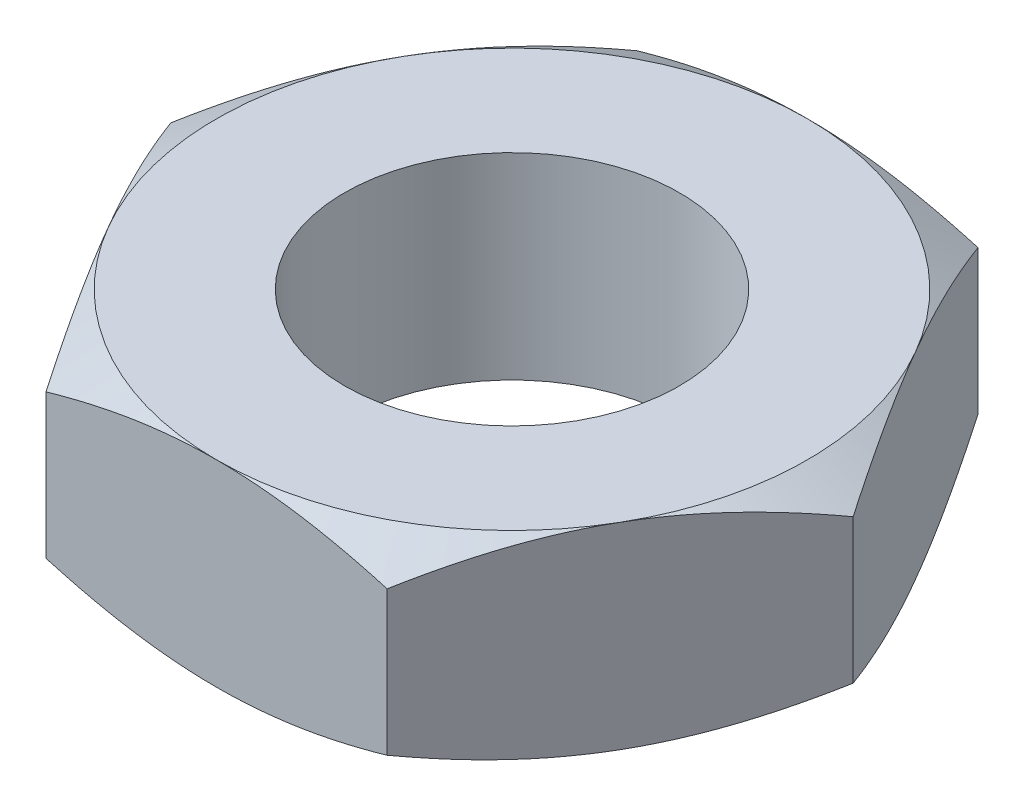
ISO-10303-21;
HEADER;
FILE_DESCRIPTION(('STEP AP214'),'2;1');
FILE_NAME('part.step','',(''),(''),'','','');
FILE_SCHEMA(('AUTOMOTIVE_DESIGN { 1 0 10303 214 1 1 1 1 }'));
ENDSEC;
DATA;
#1=APPLICATION_CONTEXT('core data for automotive mechanical design processes');
#2=APPLICATION_PROTOCOL_DEFINITION('international standard','automotive_design',2000,#1);
#3=PRODUCT_CONTEXT('',#1,'mechanical');
#4=PRODUCT('Part','Part','',(#3));
#5=PRODUCT_RELATED_PRODUCT_CATEGORY('part','',(#4));
#6=PRODUCT_DEFINITION_FORMATION('','',#4);
#7=PRODUCT_DEFINITION_CONTEXT('part definition',#1,'design');
#8=PRODUCT_DEFINITION('design','',#6,#7);
#9=PRODUCT_DEFINITION_SHAPE('','',#8);
#10=(LENGTH_UNIT() NAMED_UNIT(*) SI_UNIT(.MILLI.,.METRE.));
#11=(NAMED_UNIT(*) PLANE_ANGLE_UNIT() SI_UNIT($,.RADIAN.));
#12=(NAMED_UNIT(*) SI_UNIT($,.STERADIAN.) SOLID_ANGLE_UNIT());
#13=UNCERTAINTY_MEASURE_WITH_UNIT(LENGTH_MEASURE(1.E-05),#10,'distance_accuracy_value','');
#14=(GEOMETRIC_REPRESENTATION_CONTEXT(3) GLOBAL_UNCERTAINTY_ASSIGNED_CONTEXT((#13)) GLOBAL_UNIT_ASSIGNED_CONTEXT((#10,
#11,#12)) REPRESENTATION_CONTEXT('',''));
#15=CARTESIAN_POINT('',(0.,0.,0.));
#16=DIRECTION('',(0.,0.,1.));
#17=DIRECTION('',(1.,0.,0.));
#18=AXIS2_PLACEMENT_3D('',#15,#16,#17);
#19=CARTESIAN_POINT('',(10.3923048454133,-3.,0.));
#20=DIRECTION('',(0.,1.,0.));
#21=DIRECTION('',(0.,0.,1.));
#22=AXIS2_PLACEMENT_3D('',#19,#20,#21);
#23=PLANE('',#22);
#24=CARTESIAN_POINT('',(0.,-3.,0.));
#25=DIRECTION('',(0.,1.,0.));
#26=DIRECTION('',(0.,0.,1.));
#27=AXIS2_PLACEMENT_3D('',#24,#25,#26);
#28=CIRCLE('',#27,5.1);
#29=CARTESIAN_POINT('',(0.,-3.,5.1));
#30=VERTEX_POINT('',#29);
#31=EDGE_CURVE('E251',#30,#30,#28,.T.);
#32=ORIENTED_EDGE('',*,*,#31,.T.);
#33=EDGE_LOOP('',(#32));
#34=FACE_BOUND('',#33,.T.);
#35=CARTESIAN_POINT('',(0.,-3.,0.));
#36=DIRECTION('',(0.,1.,0.));
#37=DIRECTION('',(0.,0.,1.));
#38=AXIS2_PLACEMENT_3D('',#35,#36,#37);
#39=CIRCLE('',#38,9.00000000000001);
#40=CARTESIAN_POINT('',(0.,-3.,9.00000000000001));
#41=VERTEX_POINT('',#40);
#42=CARTESIAN_POINT('',(7.79422863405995,-3.,4.5));
#43=VERTEX_POINT('',#42);
#44=EDGE_CURVE('E137',#41,#43,#39,.T.);
#45=ORIENTED_EDGE('',*,*,#44,.F.);
#46=CARTESIAN_POINT('',(0.,-3.,0.));
#47=DIRECTION('',(0.,1.,0.));
#48=DIRECTION('',(0.,0.,1.));
#49=AXIS2_PLACEMENT_3D('',#46,#47,#48);
#50=CIRCLE('',#49,9.00000000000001);
#51=CARTESIAN_POINT('',(-7.79422863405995,-3.,4.5));
#52=VERTEX_POINT('',#51);
#53=EDGE_CURVE('E12',#41,#52,#50,.F.);
#54=ORIENTED_EDGE('',*,*,#53,.T.);
#55=CARTESIAN_POINT('',(-7.79422863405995,-3.,-4.5));
#56=VERTEX_POINT('',#55);
#57=EDGE_CURVE('E45',#52,#56,#50,.F.);
#58=ORIENTED_EDGE('',*,*,#57,.T.);
#59=CARTESIAN_POINT('',(0.,-3.,-9.00000000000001));
#60=VERTEX_POINT('',#59);
#61=EDGE_CURVE('E475',#56,#60,#50,.F.);
#62=ORIENTED_EDGE('',*,*,#61,.T.);
#63=CARTESIAN_POINT('',(7.79422863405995,-3.,-4.5));
#64=VERTEX_POINT('',#63);
#65=EDGE_CURVE('E145',#60,#64,#50,.F.);
#66=ORIENTED_EDGE('',*,*,#65,.T.);
#67=EDGE_CURVE('E46',#64,#43,#50,.F.);
#68=ORIENTED_EDGE('',*,*,#67,.T.);
#69=EDGE_LOOP('',(#45,#54,#58,#62,#66,#68));
#70=FACE_BOUND('',#69,.T.);
#71=ADVANCED_FACE('F36',(#34,#70),#23,.F.);
#72=CARTESIAN_POINT('',(5.19615242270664,3.,9.));
#73=DIRECTION('',(-0.866025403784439,0.,-0.5));
#74=DIRECTION('',(-0.5,0.,0.866025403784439));
#75=AXIS2_PLACEMENT_3D('',#72,#73,#74);
#76=PLANE('',#75);
#77=DIRECTION('',(0.,-1.,0.));
#78=VECTOR('',#77,1.);
#79=CARTESIAN_POINT('',(5.19615242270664,3.,9.));
#80=LINE('',#79,#78);
#81=CARTESIAN_POINT('',(5.19615242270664,2.19615242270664,9.));
#82=VERTEX_POINT('',#81);
#83=CARTESIAN_POINT('',(5.19615242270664,-2.19615242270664,9.));
#84=VERTEX_POINT('',#83);
#85=EDGE_CURVE('E150',#82,#84,#80,.T.);
#86=ORIENTED_EDGE('',*,*,#85,.T.);
#87=CARTESIAN_POINT('',(5.1960369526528,-2.19608575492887,9.0002));
#88=CARTESIAN_POINT('',(5.31024090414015,-2.26201799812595,8.80239295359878));
#89=CARTESIAN_POINT('',(5.42489028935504,-2.32495859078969,8.60381439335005));
#90=CARTESIAN_POINT('',(5.655120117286,-2.44403100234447,8.20504463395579));
#91=CARTESIAN_POINT('',(5.77070093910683,-2.50015988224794,8.00485277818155));
#92=CARTESIAN_POINT('',(6.00300811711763,-2.60484803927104,7.6024849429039));
#93=CARTESIAN_POINT('',(6.11973652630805,-2.65338922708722,7.4003054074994));
#94=CARTESIAN_POINT('',(6.35398725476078,-2.74185148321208,6.99457124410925));
#95=CARTESIAN_POINT('',(6.47150940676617,-2.78177431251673,6.79101690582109));
#96=CARTESIAN_POINT('',(6.70436794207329,-2.85131532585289,6.38769409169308));
#97=CARTESIAN_POINT('',(6.81968712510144,-2.8811624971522,6.18795540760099));
#98=CARTESIAN_POINT('',(7.05084147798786,-2.93120669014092,5.787584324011));
#99=CARTESIAN_POINT('',(7.16667660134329,-2.95140456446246,5.58695200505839));
#100=CARTESIAN_POINT('',(7.39854776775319,-2.98164565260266,5.18533936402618));
#101=CARTESIAN_POINT('',(7.51458343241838,-2.9917003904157,4.98435969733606));
#102=CARTESIAN_POINT('',(7.74676155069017,-3.00143766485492,4.58221540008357));
#103=CARTESIAN_POINT('',(7.86290400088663,-3.00112052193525,4.38105077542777));
#104=CARTESIAN_POINT('',(8.08003584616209,-2.99083604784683,4.00496738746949));
#105=CARTESIAN_POINT('',(8.18104055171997,-2.9821232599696,3.83002210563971));
#106=CARTESIAN_POINT('',(8.38281337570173,-2.95702265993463,3.48054132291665));
#107=CARTESIAN_POINT('',(8.48358147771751,-2.94063433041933,3.30600585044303));
#108=CARTESIAN_POINT('',(8.78549567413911,-2.88034344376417,2.78307512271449));
#109=CARTESIAN_POINT('',(8.98610736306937,-2.82532251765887,2.43560548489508));
#110=CARTESIAN_POINT('',(9.3894587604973,-2.68776952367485,1.736980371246));
#111=CARTESIAN_POINT('',(9.59214699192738,-2.60465438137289,1.38591405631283));
#112=CARTESIAN_POINT('',(9.99450087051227,-2.41601746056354,0.689016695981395));
#113=CARTESIAN_POINT('',(10.1941716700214,-2.31053998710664,0.343176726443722));
#114=CARTESIAN_POINT('',(10.3924203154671,-2.19608575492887,-0.000199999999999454));
#115=B_SPLINE_CURVE_WITH_KNOTS('',3,(#87,#88,#89,#90,#91,#92,#93,#94,#95,#96,#97,#98,#99,#100,
#101,#102,#103,#104,#105,#106,#107,#108,#109,#110,#111,#112,#113,#114),.UNSPECIFIED.,.F.,.F.,(4,
2,2,2,2,2,2,2,2,2,2,2,2,4),(0.,0.713219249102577,1.42674513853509,2.14194697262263,
2.85700253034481,3.55449749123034,4.25193080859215,4.94857085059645,5.64518936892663,
6.25162976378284,6.85811104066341,8.07193747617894,9.31268391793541,10.5509947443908),.UNSPECIFIED.);
#116=EDGE_CURVE('E58',#84,#43,#115,.T.);
#117=ORIENTED_EDGE('',*,*,#116,.T.);
#118=CARTESIAN_POINT('',(10.3923048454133,-2.19615242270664,0.));
#119=VERTEX_POINT('',#118);
#120=EDGE_CURVE('E126',#43,#119,#115,.T.);
#121=ORIENTED_EDGE('',*,*,#120,.T.);
#122=DIRECTION('',(0.,-1.,0.));
#123=VECTOR('',#122,1.);
#124=CARTESIAN_POINT('',(10.3923048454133,3.,0.));
#125=LINE('',#124,#123);
#126=CARTESIAN_POINT('',(10.3923048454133,2.19615242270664,0.));
#127=VERTEX_POINT('',#126);
#128=EDGE_CURVE('E267',#127,#119,#125,.T.);
#129=ORIENTED_EDGE('',*,*,#128,.F.);
#130=CARTESIAN_POINT('',(5.1960369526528,2.19608575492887,9.0002));
#131=CARTESIAN_POINT('',(5.31024090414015,2.26201799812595,8.80239295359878));
#132=CARTESIAN_POINT('',(5.42489028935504,2.32495859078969,8.60381439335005));
#133=CARTESIAN_POINT('',(5.655120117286,2.44403100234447,8.20504463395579));
#134=CARTESIAN_POINT('',(5.77070093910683,2.50015988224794,8.00485277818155));
#135=CARTESIAN_POINT('',(6.00300811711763,2.60484803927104,7.6024849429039));
#136=CARTESIAN_POINT('',(6.11973652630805,2.65338922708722,7.4003054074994));
#137=CARTESIAN_POINT('',(6.35398725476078,2.74185148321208,6.99457124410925));
#138=CARTESIAN_POINT('',(6.47150940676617,2.78177431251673,6.79101690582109));
#139=CARTESIAN_POINT('',(6.70436794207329,2.85131532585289,6.38769409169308));
#140=CARTESIAN_POINT('',(6.81968712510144,2.8811624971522,6.18795540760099));
#141=CARTESIAN_POINT('',(7.05084147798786,2.93120669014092,5.787584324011));
#142=CARTESIAN_POINT('',(7.16667660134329,2.95140456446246,5.58695200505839));
#143=CARTESIAN_POINT('',(7.39854776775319,2.98164565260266,5.18533936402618));
#144=CARTESIAN_POINT('',(7.51458343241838,2.9917003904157,4.98435969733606));
#145=CARTESIAN_POINT('',(7.74676155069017,3.00143766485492,4.58221540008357));
#146=CARTESIAN_POINT('',(7.86290400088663,3.00112052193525,4.38105077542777));
#147=CARTESIAN_POINT('',(8.08003584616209,2.99083604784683,4.00496738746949));
#148=CARTESIAN_POINT('',(8.18104055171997,2.9821232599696,3.83002210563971));
#149=CARTESIAN_POINT('',(8.38281337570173,2.95702265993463,3.48054132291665));
#150=CARTESIAN_POINT('',(8.48358147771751,2.94063433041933,3.30600585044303));
#151=CARTESIAN_POINT('',(8.78549567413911,2.88034344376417,2.78307512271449));
#152=CARTESIAN_POINT('',(8.98610736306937,2.82532251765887,2.43560548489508));
#153=CARTESIAN_POINT('',(9.3894587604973,2.68776952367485,1.736980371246));
#154=CARTESIAN_POINT('',(9.59214699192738,2.60465438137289,1.38591405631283));
#155=CARTESIAN_POINT('',(9.99450087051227,2.41601746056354,0.689016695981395));
#156=CARTESIAN_POINT('',(10.1941716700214,2.31053998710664,0.343176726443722));
#157=CARTESIAN_POINT('',(10.3924203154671,2.19608575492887,-0.000199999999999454));
#158=B_SPLINE_CURVE_WITH_KNOTS('',3,(#130,#131,#132,#133,#134,#135,#136,#137,#138,#139,#140,
#141,#142,#143,#144,#145,#146,#147,#148,#149,#150,#151,#152,#153,#154,#155,#156,#157),
.UNSPECIFIED.,.F.,.F.,(4,2,2,2,2,2,2,2,2,2,2,2,2,4),(0.,0.713219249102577,1.42674513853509,
2.14194697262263,2.85700253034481,3.55449749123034,4.25193080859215,4.94857085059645,
5.64518936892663,6.25162976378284,6.85811104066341,8.07193747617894,9.31268391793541,
10.5509947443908),.UNSPECIFIED.);
#159=CARTESIAN_POINT('',(7.79422863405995,3.,4.5));
#160=VERTEX_POINT('',#159);
#161=EDGE_CURVE('E241',#160,#127,#158,.T.);
#162=ORIENTED_EDGE('',*,*,#161,.F.);
#163=EDGE_CURVE('E247',#82,#160,#158,.T.);
#164=ORIENTED_EDGE('',*,*,#163,.F.);
#165=EDGE_LOOP('',(#86,#117,#121,#129,#162,#164));
#166=FACE_BOUND('',#165,.T.);
#167=ADVANCED_FACE('F38',(#166),#76,.F.);
#168=CARTESIAN_POINT('',(10.3923048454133,3.,0.));
#169=DIRECTION('',(-0.866025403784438,0.,0.5));
#170=DIRECTION('',(0.5,0.,0.866025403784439));
#171=AXIS2_PLACEMENT_3D('',#168,#169,#170);
#172=PLANE('',#171);
#173=ORIENTED_EDGE('',*,*,#128,.T.);
#174=CARTESIAN_POINT('',(10.3924203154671,-2.19608575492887,0.000200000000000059));
#175=CARTESIAN_POINT('',(10.2782163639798,-2.26201799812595,-0.197607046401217));
#176=CARTESIAN_POINT('',(10.1635669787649,-2.32495859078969,-0.396185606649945));
#177=CARTESIAN_POINT('',(9.93333715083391,-2.44403100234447,-0.79495536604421));
#178=CARTESIAN_POINT('',(9.81775632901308,-2.50015988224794,-0.995147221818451));
#179=CARTESIAN_POINT('',(9.58544915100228,-2.60484803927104,-1.3975150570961));
#180=CARTESIAN_POINT('',(9.46872074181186,-2.65338922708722,-1.5996945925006));
#181=CARTESIAN_POINT('',(9.23447001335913,-2.74185148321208,-2.00542875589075));
#182=CARTESIAN_POINT('',(9.11694786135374,-2.78177431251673,-2.20898309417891));
#183=CARTESIAN_POINT('',(8.88408932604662,-2.85131532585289,-2.61230590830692));
#184=CARTESIAN_POINT('',(8.76877014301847,-2.8811624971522,-2.81204459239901));
#185=CARTESIAN_POINT('',(8.53761579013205,-2.93120669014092,-3.212415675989));
#186=CARTESIAN_POINT('',(8.42178066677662,-2.95140456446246,-3.41304799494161));
#187=CARTESIAN_POINT('',(8.18990950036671,-2.98164565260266,-3.81466063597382));
#188=CARTESIAN_POINT('',(8.07387383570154,-2.9917003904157,-4.01564030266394));
#189=CARTESIAN_POINT('',(7.84169571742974,-3.00143766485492,-4.41778459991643));
#190=CARTESIAN_POINT('',(7.72555326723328,-3.00112052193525,-4.61894922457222));
#191=CARTESIAN_POINT('',(7.50842142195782,-2.99083604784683,-4.9950326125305));
#192=CARTESIAN_POINT('',(7.40741671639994,-2.98212325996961,-5.16997789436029));
#193=CARTESIAN_POINT('',(7.20564389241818,-2.95702265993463,-5.51945867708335));
#194=CARTESIAN_POINT('',(7.1048757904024,-2.94063433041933,-5.69399414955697));
#195=CARTESIAN_POINT('',(6.8029615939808,-2.88034344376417,-6.21692487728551));
#196=CARTESIAN_POINT('',(6.60234990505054,-2.82532251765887,-6.56439451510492));
#197=CARTESIAN_POINT('',(6.19899850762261,-2.68776952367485,-7.263019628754));
#198=CARTESIAN_POINT('',(5.99631027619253,-2.6046543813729,-7.61408594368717));
#199=CARTESIAN_POINT('',(5.59395639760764,-2.41601746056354,-8.31098330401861));
#200=CARTESIAN_POINT('',(5.39428559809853,-2.31053998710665,-8.65682327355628));
#201=CARTESIAN_POINT('',(5.19603695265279,-2.19608575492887,-9.0002));
#202=B_SPLINE_CURVE_WITH_KNOTS('',3,(#174,#175,#176,#177,#178,#179,#180,#181,#182,#183,#184,
#185,#186,#187,#188,#189,#190,#191,#192,#193,#194,#195,#196,#197,#198,#199,#200,#201),
.UNSPECIFIED.,.F.,.F.,(4,2,2,2,2,2,2,2,2,2,2,2,2,4),(0.,0.713219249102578,1.42674513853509,
2.14194697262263,2.85700253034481,3.55449749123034,4.25193080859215,4.94857085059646,
5.64518936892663,6.25162976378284,6.85811104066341,8.07193747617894,9.31268391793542,
10.5509947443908),.UNSPECIFIED.);
#203=EDGE_CURVE('E131',#119,#64,#202,.T.);
#204=ORIENTED_EDGE('',*,*,#203,.T.);
#205=CARTESIAN_POINT('',(5.19615242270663,-2.19615242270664,-9.));
#206=VERTEX_POINT('',#205);
#207=EDGE_CURVE('E161',#64,#206,#202,.T.);
#208=ORIENTED_EDGE('',*,*,#207,.T.);
#209=DIRECTION('',(0.,-1.,0.));
#210=VECTOR('',#209,1.);
#211=CARTESIAN_POINT('',(5.19615242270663,3.,-9.));
#212=LINE('',#211,#210);
#213=CARTESIAN_POINT('',(5.19615242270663,2.19615242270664,-9.));
#214=VERTEX_POINT('',#213);
#215=EDGE_CURVE('E264',#214,#206,#212,.T.);
#216=ORIENTED_EDGE('',*,*,#215,.F.);
#217=CARTESIAN_POINT('',(10.3924203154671,2.19608575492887,0.000200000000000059));
#218=CARTESIAN_POINT('',(10.2782163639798,2.26201799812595,-0.197607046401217));
#219=CARTESIAN_POINT('',(10.1635669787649,2.32495859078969,-0.396185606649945));
#220=CARTESIAN_POINT('',(9.93333715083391,2.44403100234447,-0.79495536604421));
#221=CARTESIAN_POINT('',(9.81775632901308,2.50015988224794,-0.995147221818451));
#222=CARTESIAN_POINT('',(9.58544915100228,2.60484803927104,-1.3975150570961));
#223=CARTESIAN_POINT('',(9.46872074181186,2.65338922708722,-1.5996945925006));
#224=CARTESIAN_POINT('',(9.23447001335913,2.74185148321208,-2.00542875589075));
#225=CARTESIAN_POINT('',(9.11694786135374,2.78177431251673,-2.20898309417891));
#226=CARTESIAN_POINT('',(8.88408932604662,2.85131532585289,-2.61230590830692));
#227=CARTESIAN_POINT('',(8.76877014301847,2.8811624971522,-2.81204459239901));
#228=CARTESIAN_POINT('',(8.53761579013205,2.93120669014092,-3.212415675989));
#229=CARTESIAN_POINT('',(8.42178066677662,2.95140456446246,-3.41304799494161));
#230=CARTESIAN_POINT('',(8.18990950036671,2.98164565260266,-3.81466063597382));
#231=CARTESIAN_POINT('',(8.07387383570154,2.9917003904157,-4.01564030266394));
#232=CARTESIAN_POINT('',(7.84169571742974,3.00143766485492,-4.41778459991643));
#233=CARTESIAN_POINT('',(7.72555326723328,3.00112052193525,-4.61894922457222));
#234=CARTESIAN_POINT('',(7.50842142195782,2.99083604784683,-4.9950326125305));
#235=CARTESIAN_POINT('',(7.40741671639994,2.98212325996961,-5.16997789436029));
#236=CARTESIAN_POINT('',(7.20564389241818,2.95702265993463,-5.51945867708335));
#237=CARTESIAN_POINT('',(7.1048757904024,2.94063433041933,-5.69399414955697));
#238=CARTESIAN_POINT('',(6.8029615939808,2.88034344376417,-6.21692487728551));
#239=CARTESIAN_POINT('',(6.60234990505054,2.82532251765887,-6.56439451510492));
#240=CARTESIAN_POINT('',(6.19899850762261,2.68776952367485,-7.263019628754));
#241=CARTESIAN_POINT('',(5.99631027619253,2.6046543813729,-7.61408594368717));
#242=CARTESIAN_POINT('',(5.59395639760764,2.41601746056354,-8.31098330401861));
#243=CARTESIAN_POINT('',(5.39428559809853,2.31053998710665,-8.65682327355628));
#244=CARTESIAN_POINT('',(5.19603695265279,2.19608575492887,-9.0002));
#245=B_SPLINE_CURVE_WITH_KNOTS('',3,(#217,#218,#219,#220,#221,#222,#223,#224,#225,#226,#227,
#228,#229,#230,#231,#232,#233,#234,#235,#236,#237,#238,#239,#240,#241,#242,#243,#244),
.UNSPECIFIED.,.F.,.F.,(4,2,2,2,2,2,2,2,2,2,2,2,2,4),(0.,0.713219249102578,1.42674513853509,
2.14194697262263,2.85700253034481,3.55449749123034,4.25193080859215,4.94857085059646,
5.64518936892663,6.25162976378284,6.85811104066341,8.07193747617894,9.31268391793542,
10.5509947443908),.UNSPECIFIED.);
#246=CARTESIAN_POINT('',(7.79422863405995,3.,-4.5));
#247=VERTEX_POINT('',#246);
#248=EDGE_CURVE('E234',#247,#214,#245,.T.);
#249=ORIENTED_EDGE('',*,*,#248,.F.);
#250=EDGE_CURVE('E240',#127,#247,#245,.T.);
#251=ORIENTED_EDGE('',*,*,#250,.F.);
#252=EDGE_LOOP('',(#173,#204,#208,#216,#249,#251));
#253=FACE_BOUND('',#252,.T.);
#254=ADVANCED_FACE('F213',(#253),#172,.F.);
#255=CARTESIAN_POINT('',(5.19615242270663,3.,-9.));
#256=DIRECTION('',(0.,0.,1.));
#257=DIRECTION('',(1.,0.,0.));
#258=AXIS2_PLACEMENT_3D('',#255,#256,#257);
#259=PLANE('',#258);
#260=ORIENTED_EDGE('',*,*,#215,.T.);
#261=CARTESIAN_POINT('',(-14.08790952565,1.45560380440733,-9.));
#262=CARTESIAN_POINT('',(-13.6936550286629,1.26383430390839,-9.));
#263=CARTESIAN_POINT('',(-13.2985092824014,1.07386641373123,-9.));
#264=CARTESIAN_POINT('',(-12.505961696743,0.698544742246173,-9.));
#265=CARTESIAN_POINT('',(-12.1085595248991,0.513191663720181,-9.));
#266=CARTESIAN_POINT('',(-11.309040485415,0.147206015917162,-9.));
#267=CARTESIAN_POINT('',(-10.9069098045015,-0.033396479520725,-9.));
#268=CARTESIAN_POINT('',(-10.0994948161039,-0.387381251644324,-9.));
#269=CARTESIAN_POINT('',(-9.69421065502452,-0.560763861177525,-9.));
#270=CARTESIAN_POINT('',(-8.86637898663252,-0.903989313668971,-9.));
#271=CARTESIAN_POINT('',(-8.44370370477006,-1.07352564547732,-9.));
#272=CARTESIAN_POINT('',(-7.59345787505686,-1.40008012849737,-9.));
#273=CARTESIAN_POINT('',(-7.16588679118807,-1.55709689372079,-9.));
#274=CARTESIAN_POINT('',(-6.30592235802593,-1.85458596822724,-9.));
#275=CARTESIAN_POINT('',(-5.87354032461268,-1.99509064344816,-9.));
#276=CARTESIAN_POINT('',(-5.00259089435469,-2.25513543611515,-9.));
#277=CARTESIAN_POINT('',(-4.56402544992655,-2.37468201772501,-9.));
#278=CARTESIAN_POINT('',(-3.68279147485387,-2.58652518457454,-9.));
#279=CARTESIAN_POINT('',(-3.24015978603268,-2.67897094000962,-9.));
#280=CARTESIAN_POINT('',(-2.57207975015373,-2.79336659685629,-9.));
#281=CARTESIAN_POINT('',(-2.34868256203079,-2.82745445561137,-9.));
#282=CARTESIAN_POINT('',(-1.90073399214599,-2.88687397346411,-9.));
#283=CARTESIAN_POINT('',(-1.67618272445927,-2.91220648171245,-9.));
#284=CARTESIAN_POINT('',(-1.22921881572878,-2.95328578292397,-9.));
#285=CARTESIAN_POINT('',(-1.00681754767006,-2.96915580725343,-9.));
#286=CARTESIAN_POINT('',(-0.561542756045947,-2.99147045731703,-9.));
#287=CARTESIAN_POINT('',(-0.338669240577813,-2.99791524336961,-9.));
#288=CARTESIAN_POINT('',(0.107152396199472,-3.00122518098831,-9.));
#289=CARTESIAN_POINT('',(0.330100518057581,-2.99809026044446,-9.));
#290=CARTESIAN_POINT('',(0.775663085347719,-2.98231893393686,-9.));
#291=CARTESIAN_POINT('',(0.998277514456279,-2.96968207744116,-9.));
#292=CARTESIAN_POINT('',(1.52928538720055,-2.92847699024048,-9.));
#293=CARTESIAN_POINT('',(1.83735365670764,-2.89562319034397,-9.));
#294=CARTESIAN_POINT('',(2.45127496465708,-2.81348089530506,-9.));
#295=CARTESIAN_POINT('',(2.75712771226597,-2.76419028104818,-9.));
#296=CARTESIAN_POINT('',(3.67096429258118,-2.59427111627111,-9.));
#297=CARTESIAN_POINT('',(4.27491194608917,-2.4516229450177,-9.));
#298=CARTESIAN_POINT('',(5.17834875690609,-2.2032990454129,-9.));
#299=CARTESIAN_POINT('',(5.48249505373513,-2.11358460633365,-9.));
#300=CARTESIAN_POINT('',(6.0878349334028,-1.92460437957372,-9.));
#301=CARTESIAN_POINT('',(6.38902849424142,-1.82533852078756,-9.));
#302=CARTESIAN_POINT('',(6.9885562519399,-1.61886770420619,-9.));
#303=CARTESIAN_POINT('',(7.28689127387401,-1.51166512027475,-9.));
#304=CARTESIAN_POINT('',(7.88107084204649,-1.29060569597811,-9.));
#305=CARTESIAN_POINT('',(8.17691543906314,-1.17674899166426,-9.));
#306=CARTESIAN_POINT('',(8.95441621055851,-0.869086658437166,-9.));
#307=CARTESIAN_POINT('',(9.43422210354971,-0.670610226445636,-9.));
#308=CARTESIAN_POINT('',(10.3890689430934,-0.262470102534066,-9.));
#309=CARTESIAN_POINT('',(10.8641094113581,-0.0528053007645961,-9.));
#310=CARTESIAN_POINT('',(11.8104820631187,0.375135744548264,-9.));
#311=CARTESIAN_POINT('',(12.2818128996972,0.593414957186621,-9.));
#312=CARTESIAN_POINT('',(13.2213264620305,1.0365822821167,-9.));
#313=CARTESIAN_POINT('',(13.6895093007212,1.26147015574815,-9.));
#314=CARTESIAN_POINT('',(14.624030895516,1.71679166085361,-9.));
#315=CARTESIAN_POINT('',(15.0903658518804,1.94723307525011,-9.));
#316=CARTESIAN_POINT('',(16.0209541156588,2.41228312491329,-9.));
#317=CARTESIAN_POINT('',(16.4852074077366,2.64689179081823,-9.));
#318=CARTESIAN_POINT('',(17.4119022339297,3.11942878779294,-9.));
#319=CARTESIAN_POINT('',(17.8743441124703,3.35735644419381,-9.));
#320=CARTESIAN_POINT('',(18.7977988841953,3.83597043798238,-9.));
#321=CARTESIAN_POINT('',(19.2588117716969,4.07665678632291,-9.));
#322=CARTESIAN_POINT('',(20.5465513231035,4.75300835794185,-9.));
#323=CARTESIAN_POINT('',(21.3719486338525,5.19120416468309,-9.00000000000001));
#324=CARTESIAN_POINT('',(23.0199314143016,6.07294903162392,-9.00000000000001));
#325=CARTESIAN_POINT('',(23.8425167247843,6.51649838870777,-9.00000000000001));
#326=CARTESIAN_POINT('',(25.4829119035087,7.40619804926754,-9.00000000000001));
#327=CARTESIAN_POINT('',(26.3007286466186,7.85233568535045,-9.00000000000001));
#328=CARTESIAN_POINT('',(27.5261617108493,8.5238268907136,-9.00000000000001));
#329=CARTESIAN_POINT('',(27.9344093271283,8.74802994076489,-9.00000000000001));
#330=CARTESIAN_POINT('',(28.7505282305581,9.19711874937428,-9.00000000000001));
#331=CARTESIAN_POINT('',(29.1583995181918,9.42200450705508,-9.00000000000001));
#332=CARTESIAN_POINT('',(29.5661053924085,9.64718982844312,-9.00000000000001));
#333=B_SPLINE_CURVE_WITH_KNOTS('',3,(#261,#262,#263,#264,#265,#266,#267,#268,#269,#270,#271,
#272,#273,#274,#275,#276,#277,#278,#279,#280,#281,#282,#283,#284,#285,#286,#287,#288,#289,#290,
#291,#292,#293,#294,#295,#296,#297,#298,#299,#300,#301,#302,#303,#304,#305,#306,#307,#308,#309,
#310,#311,#312,#313,#314,#315,#316,#317,#318,#319,#320,#321,#322,#323,#324,#325,#326,#327,#328,
#329,#330,#331,#332),.UNSPECIFIED.,.F.,.F.,(4,2,2,2,2,2,2,2,2,2,2,2,2,2,2,2,2,2,2,2,2,2,2,2,2,2,
2,2,2,2,2,2,2,2,2,4),(0.,1.31527562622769,2.63075034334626,3.95316726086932,5.27552314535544,
6.64159484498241,8.00781756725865,9.37131599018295,10.7343931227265,12.0898202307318,
12.7676245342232,13.4453630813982,14.1140707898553,14.7827671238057,15.4514684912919,
16.1202015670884,17.0491251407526,17.9781685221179,19.8371982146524,20.7884210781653,
21.7396510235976,22.6905975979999,23.6415247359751,25.199025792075,26.7566816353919,
28.3148791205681,29.8730204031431,31.4334893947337,32.9939698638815,34.5541376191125,
36.1143115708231,38.9177907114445,41.7214260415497,44.5161918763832,45.9134738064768,
47.3107539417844),.UNSPECIFIED.);
#334=EDGE_CURVE('E207',#206,#60,#333,.F.);
#335=ORIENTED_EDGE('',*,*,#334,.T.);
#336=CARTESIAN_POINT('',(-5.19615242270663,-2.19615242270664,-9.));
#337=VERTEX_POINT('',#336);
#338=EDGE_CURVE('E200',#60,#337,#333,.F.);
#339=ORIENTED_EDGE('',*,*,#338,.T.);
#340=DIRECTION('',(0.,-1.,0.));
#341=VECTOR('',#340,1.);
#342=CARTESIAN_POINT('',(-5.19615242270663,3.,-9.));
#343=LINE('',#342,#341);
#344=CARTESIAN_POINT('',(-5.19615242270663,2.19615242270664,-9.));
#345=VERTEX_POINT('',#344);
#346=EDGE_CURVE('E261',#345,#337,#343,.T.);
#347=ORIENTED_EDGE('',*,*,#346,.F.);
#348=CARTESIAN_POINT('',(-14.08790952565,-1.45560380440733,-9.));
#349=CARTESIAN_POINT('',(-13.6936550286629,-1.26383430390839,-9.));
#350=CARTESIAN_POINT('',(-13.2985092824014,-1.07386641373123,-9.));
#351=CARTESIAN_POINT('',(-12.505961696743,-0.698544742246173,-9.));
#352=CARTESIAN_POINT('',(-12.1085595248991,-0.513191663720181,-9.));
#353=CARTESIAN_POINT('',(-11.309040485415,-0.147206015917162,-9.));
#354=CARTESIAN_POINT('',(-10.9069098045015,0.033396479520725,-9.));
#355=CARTESIAN_POINT('',(-10.0994948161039,0.387381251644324,-9.));
#356=CARTESIAN_POINT('',(-9.69421065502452,0.560763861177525,-9.));
#357=CARTESIAN_POINT('',(-8.86637898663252,0.903989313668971,-9.));
#358=CARTESIAN_POINT('',(-8.44370370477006,1.07352564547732,-9.));
#359=CARTESIAN_POINT('',(-7.59345787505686,1.40008012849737,-9.));
#360=CARTESIAN_POINT('',(-7.16588679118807,1.55709689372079,-9.));
#361=CARTESIAN_POINT('',(-6.30592235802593,1.85458596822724,-9.));
#362=CARTESIAN_POINT('',(-5.87354032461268,1.99509064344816,-9.));
#363=CARTESIAN_POINT('',(-5.00259089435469,2.25513543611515,-9.));
#364=CARTESIAN_POINT('',(-4.56402544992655,2.37468201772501,-9.));
#365=CARTESIAN_POINT('',(-3.68279147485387,2.58652518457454,-9.));
#366=CARTESIAN_POINT('',(-3.24015978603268,2.67897094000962,-9.));
#367=CARTESIAN_POINT('',(-2.57207975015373,2.79336659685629,-9.));
#368=CARTESIAN_POINT('',(-2.34868256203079,2.82745445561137,-9.));
#369=CARTESIAN_POINT('',(-1.90073399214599,2.88687397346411,-9.));
#370=CARTESIAN_POINT('',(-1.67618272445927,2.91220648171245,-9.));
#371=CARTESIAN_POINT('',(-1.22921881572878,2.95328578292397,-9.));
#372=CARTESIAN_POINT('',(-1.00681754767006,2.96915580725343,-9.));
#373=CARTESIAN_POINT('',(-0.561542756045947,2.99147045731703,-9.));
#374=CARTESIAN_POINT('',(-0.338669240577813,2.99791524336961,-9.));
#375=CARTESIAN_POINT('',(0.107152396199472,3.00122518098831,-9.));
#376=CARTESIAN_POINT('',(0.330100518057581,2.99809026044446,-9.));
#377=CARTESIAN_POINT('',(0.775663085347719,2.98231893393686,-9.));
#378=CARTESIAN_POINT('',(0.998277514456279,2.96968207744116,-9.));
#379=CARTESIAN_POINT('',(1.52928538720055,2.92847699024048,-9.));
#380=CARTESIAN_POINT('',(1.83735365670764,2.89562319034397,-9.));
#381=CARTESIAN_POINT('',(2.45127496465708,2.81348089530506,-9.));
#382=CARTESIAN_POINT('',(2.75712771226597,2.76419028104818,-9.));
#383=CARTESIAN_POINT('',(3.67096429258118,2.59427111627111,-9.));
#384=CARTESIAN_POINT('',(4.27491194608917,2.4516229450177,-9.));
#385=CARTESIAN_POINT('',(5.17834875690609,2.2032990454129,-9.));
#386=CARTESIAN_POINT('',(5.48249505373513,2.11358460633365,-9.));
#387=CARTESIAN_POINT('',(6.0878349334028,1.92460437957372,-9.));
#388=CARTESIAN_POINT('',(6.38902849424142,1.82533852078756,-9.));
#389=CARTESIAN_POINT('',(6.9885562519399,1.61886770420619,-9.));
#390=CARTESIAN_POINT('',(7.28689127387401,1.51166512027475,-9.));
#391=CARTESIAN_POINT('',(7.88107084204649,1.29060569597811,-9.));
#392=CARTESIAN_POINT('',(8.17691543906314,1.17674899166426,-9.));
#393=CARTESIAN_POINT('',(8.95441621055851,0.869086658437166,-9.));
#394=CARTESIAN_POINT('',(9.43422210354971,0.670610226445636,-9.));
#395=CARTESIAN_POINT('',(10.3890689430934,0.262470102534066,-9.));
#396=CARTESIAN_POINT('',(10.8641094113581,0.0528053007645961,-9.));
#397=CARTESIAN_POINT('',(11.8104820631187,-0.375135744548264,-9.));
#398=CARTESIAN_POINT('',(12.2818128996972,-0.593414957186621,-9.));
#399=CARTESIAN_POINT('',(13.2213264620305,-1.0365822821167,-9.));
#400=CARTESIAN_POINT('',(13.6895093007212,-1.26147015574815,-9.));
#401=CARTESIAN_POINT('',(14.624030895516,-1.71679166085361,-9.));
#402=CARTESIAN_POINT('',(15.0903658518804,-1.94723307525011,-9.));
#403=CARTESIAN_POINT('',(16.0209541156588,-2.41228312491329,-9.));
#404=CARTESIAN_POINT('',(16.4852074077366,-2.64689179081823,-9.));
#405=CARTESIAN_POINT('',(17.4119022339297,-3.11942878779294,-9.));
#406=CARTESIAN_POINT('',(17.8743441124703,-3.35735644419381,-9.));
#407=CARTESIAN_POINT('',(18.7977988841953,-3.83597043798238,-9.));
#408=CARTESIAN_POINT('',(19.2588117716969,-4.07665678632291,-9.));
#409=CARTESIAN_POINT('',(20.5465513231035,-4.75300835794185,-9.));
#410=CARTESIAN_POINT('',(21.3719486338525,-5.19120416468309,-9.00000000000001));
#411=CARTESIAN_POINT('',(23.0199314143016,-6.07294903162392,-9.00000000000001));
#412=CARTESIAN_POINT('',(23.8425167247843,-6.51649838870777,-9.00000000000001));
#413=CARTESIAN_POINT('',(25.4829119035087,-7.40619804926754,-9.00000000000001));
#414=CARTESIAN_POINT('',(26.3007286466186,-7.85233568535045,-9.00000000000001));
#415=CARTESIAN_POINT('',(27.5261617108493,-8.5238268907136,-9.00000000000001));
#416=CARTESIAN_POINT('',(27.9344093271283,-8.74802994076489,-9.00000000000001));
#417=CARTESIAN_POINT('',(28.7505282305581,-9.19711874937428,-9.00000000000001));
#418=CARTESIAN_POINT('',(29.1583995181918,-9.42200450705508,-9.00000000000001));
#419=CARTESIAN_POINT('',(29.5661053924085,-9.64718982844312,-9.00000000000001));
#420=B_SPLINE_CURVE_WITH_KNOTS('',3,(#348,#349,#350,#351,#352,#353,#354,#355,#356,#357,#358,
#359,#360,#361,#362,#363,#364,#365,#366,#367,#368,#369,#370,#371,#372,#373,#374,#375,#376,#377,
#378,#379,#380,#381,#382,#383,#384,#385,#386,#387,#388,#389,#390,#391,#392,#393,#394,#395,#396,
#397,#398,#399,#400,#401,#402,#403,#404,#405,#406,#407,#408,#409,#410,#411,#412,#413,#414,#415,
#416,#417,#418,#419),.UNSPECIFIED.,.F.,.F.,(4,2,2,2,2,2,2,2,2,2,2,2,2,2,2,2,2,2,2,2,2,2,2,2,2,2,
2,2,2,2,2,2,2,2,2,4),(0.,1.31527562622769,2.63075034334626,3.95316726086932,5.27552314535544,
6.64159484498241,8.00781756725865,9.37131599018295,10.7343931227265,12.0898202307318,
12.7676245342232,13.4453630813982,14.1140707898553,14.7827671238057,15.4514684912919,
16.1202015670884,17.0491251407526,17.9781685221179,19.8371982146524,20.7884210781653,
21.7396510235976,22.6905975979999,23.6415247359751,25.199025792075,26.7566816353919,
28.3148791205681,29.8730204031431,31.4334893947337,32.9939698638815,34.5541376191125,
36.1143115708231,38.9177907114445,41.7214260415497,44.5161918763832,45.9134738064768,
47.3107539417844),.UNSPECIFIED.);
#421=CARTESIAN_POINT('',(0.,3.,-9.00000000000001));
#422=VERTEX_POINT('',#421);
#423=EDGE_CURVE('E219',#422,#345,#420,.F.);
#424=ORIENTED_EDGE('',*,*,#423,.F.);
#425=EDGE_CURVE('E226',#214,#422,#420,.F.);
#426=ORIENTED_EDGE('',*,*,#425,.F.);
#427=EDGE_LOOP('',(#260,#335,#339,#347,#424,#426));
#428=FACE_BOUND('',#427,.T.);
#429=ADVANCED_FACE('F209',(#428),#259,.F.);
#430=CARTESIAN_POINT('',(-5.19615242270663,3.,-9.));
#431=DIRECTION('',(0.866025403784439,0.,0.5));
#432=DIRECTION('',(0.5,0.,-0.866025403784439));
#433=AXIS2_PLACEMENT_3D('',#430,#431,#432);
#434=PLANE('',#433);
#435=ORIENTED_EDGE('',*,*,#346,.T.);
#436=CARTESIAN_POINT('',(-5.19603695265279,-2.19608575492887,-9.0002));
#437=CARTESIAN_POINT('',(-5.31024090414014,-2.26201799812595,-8.80239295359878));
#438=CARTESIAN_POINT('',(-5.42489028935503,-2.32495859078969,-8.60381439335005));
#439=CARTESIAN_POINT('',(-5.65512011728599,-2.44403100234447,-8.20504463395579));
#440=CARTESIAN_POINT('',(-5.77070093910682,-2.50015988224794,-8.00485277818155));
#441=CARTESIAN_POINT('',(-6.00300811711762,-2.60484803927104,-7.6024849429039));
#442=CARTESIAN_POINT('',(-6.11973652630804,-2.65338922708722,-7.4003054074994));
#443=CARTESIAN_POINT('',(-6.35398725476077,-2.74185148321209,-6.99457124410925));
#444=CARTESIAN_POINT('',(-6.47150940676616,-2.78177431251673,-6.79101690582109));
#445=CARTESIAN_POINT('',(-6.70436794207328,-2.85131532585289,-6.38769409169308));
#446=CARTESIAN_POINT('',(-6.81968712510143,-2.88116249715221,-6.187955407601));
#447=CARTESIAN_POINT('',(-7.05084147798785,-2.93120669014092,-5.787584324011));
#448=CARTESIAN_POINT('',(-7.16667660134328,-2.95140456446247,-5.58695200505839));
#449=CARTESIAN_POINT('',(-7.39854776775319,-2.98164565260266,-5.18533936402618));
#450=CARTESIAN_POINT('',(-7.51458343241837,-2.9917003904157,-4.98435969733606));
#451=CARTESIAN_POINT('',(-7.74676155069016,-3.00143766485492,-4.58221540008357));
#452=CARTESIAN_POINT('',(-7.86290400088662,-3.00112052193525,-4.38105077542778));
#453=CARTESIAN_POINT('',(-8.08003584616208,-2.99083604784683,-4.0049673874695));
#454=CARTESIAN_POINT('',(-8.18104055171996,-2.98212325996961,-3.83002210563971));
#455=CARTESIAN_POINT('',(-8.38281337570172,-2.95702265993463,-3.48054132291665));
#456=CARTESIAN_POINT('',(-8.4835814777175,-2.94063433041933,-3.30600585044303));
#457=CARTESIAN_POINT('',(-8.7854956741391,-2.88034344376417,-2.7830751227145));
#458=CARTESIAN_POINT('',(-8.98610736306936,-2.82532251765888,-2.43560548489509));
#459=CARTESIAN_POINT('',(-9.38945876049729,-2.68776952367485,-1.736980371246));
#460=CARTESIAN_POINT('',(-9.59214699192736,-2.6046543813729,-1.38591405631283));
#461=CARTESIAN_POINT('',(-9.99450087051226,-2.41601746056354,-0.6890166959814));
#462=CARTESIAN_POINT('',(-10.1941716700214,-2.31053998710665,-0.343176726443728));
#463=CARTESIAN_POINT('',(-10.3924203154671,-2.19608575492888,0.000199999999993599));
#464=B_SPLINE_CURVE_WITH_KNOTS('',3,(#436,#437,#438,#439,#440,#441,#442,#443,#444,#445,#446,
#447,#448,#449,#450,#451,#452,#453,#454,#455,#456,#457,#458,#459,#460,#461,#462,#463),
.UNSPECIFIED.,.F.,.F.,(4,2,2,2,2,2,2,2,2,2,2,2,2,4),(0.,0.713219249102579,1.42674513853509,
2.14194697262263,2.85700253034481,3.55449749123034,4.25193080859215,4.94857085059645,
5.64518936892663,6.25162976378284,6.8581110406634,8.07193747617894,9.31268391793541,
10.5509947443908),.UNSPECIFIED.);
#465=EDGE_CURVE('E208',#337,#56,#464,.T.);
#466=ORIENTED_EDGE('',*,*,#465,.T.);
#467=CARTESIAN_POINT('',(-10.3923048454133,-2.19615242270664,0.));
#468=VERTEX_POINT('',#467);
#469=EDGE_CURVE('E194',#56,#468,#464,.T.);
#470=ORIENTED_EDGE('',*,*,#469,.T.);
#471=DIRECTION('',(0.,-1.,0.));
#472=VECTOR('',#471,1.);
#473=CARTESIAN_POINT('',(-10.3923048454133,3.,0.));
#474=LINE('',#473,#472);
#475=CARTESIAN_POINT('',(-10.3923048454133,2.19615242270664,0.));
#476=VERTEX_POINT('',#475);
#477=EDGE_CURVE('E258',#476,#468,#474,.T.);
#478=ORIENTED_EDGE('',*,*,#477,.F.);
#479=CARTESIAN_POINT('',(-5.19603695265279,2.19608575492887,-9.0002));
#480=CARTESIAN_POINT('',(-5.31024090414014,2.26201799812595,-8.80239295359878));
#481=CARTESIAN_POINT('',(-5.42489028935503,2.32495859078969,-8.60381439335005));
#482=CARTESIAN_POINT('',(-5.65512011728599,2.44403100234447,-8.20504463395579));
#483=CARTESIAN_POINT('',(-5.77070093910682,2.50015988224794,-8.00485277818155));
#484=CARTESIAN_POINT('',(-6.00300811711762,2.60484803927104,-7.6024849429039));
#485=CARTESIAN_POINT('',(-6.11973652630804,2.65338922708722,-7.4003054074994));
#486=CARTESIAN_POINT('',(-6.35398725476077,2.74185148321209,-6.99457124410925));
#487=CARTESIAN_POINT('',(-6.47150940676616,2.78177431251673,-6.79101690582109));
#488=CARTESIAN_POINT('',(-6.70436794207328,2.85131532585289,-6.38769409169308));
#489=CARTESIAN_POINT('',(-6.81968712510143,2.88116249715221,-6.187955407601));
#490=CARTESIAN_POINT('',(-7.05084147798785,2.93120669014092,-5.787584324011));
#491=CARTESIAN_POINT('',(-7.16667660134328,2.95140456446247,-5.58695200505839));
#492=CARTESIAN_POINT('',(-7.39854776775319,2.98164565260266,-5.18533936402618));
#493=CARTESIAN_POINT('',(-7.51458343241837,2.9917003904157,-4.98435969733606));
#494=CARTESIAN_POINT('',(-7.74676155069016,3.00143766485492,-4.58221540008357));
#495=CARTESIAN_POINT('',(-7.86290400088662,3.00112052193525,-4.38105077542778));
#496=CARTESIAN_POINT('',(-8.08003584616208,2.99083604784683,-4.0049673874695));
#497=CARTESIAN_POINT('',(-8.18104055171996,2.98212325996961,-3.83002210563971));
#498=CARTESIAN_POINT('',(-8.38281337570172,2.95702265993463,-3.48054132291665));
#499=CARTESIAN_POINT('',(-8.4835814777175,2.94063433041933,-3.30600585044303));
#500=CARTESIAN_POINT('',(-8.7854956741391,2.88034344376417,-2.7830751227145));
#501=CARTESIAN_POINT('',(-8.98610736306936,2.82532251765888,-2.43560548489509));
#502=CARTESIAN_POINT('',(-9.38945876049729,2.68776952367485,-1.736980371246));
#503=CARTESIAN_POINT('',(-9.59214699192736,2.6046543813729,-1.38591405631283));
#504=CARTESIAN_POINT('',(-9.99450087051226,2.41601746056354,-0.6890166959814));
#505=CARTESIAN_POINT('',(-10.1941716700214,2.31053998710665,-0.343176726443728));
#506=CARTESIAN_POINT('',(-10.3924203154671,2.19608575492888,0.000199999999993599));
#507=B_SPLINE_CURVE_WITH_KNOTS('',3,(#479,#480,#481,#482,#483,#484,#485,#486,#487,#488,#489,
#490,#491,#492,#493,#494,#495,#496,#497,#498,#499,#500,#501,#502,#503,#504,#505,#506),
.UNSPECIFIED.,.F.,.F.,(4,2,2,2,2,2,2,2,2,2,2,2,2,4),(0.,0.713219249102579,1.42674513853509,
2.14194697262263,2.85700253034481,3.55449749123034,4.25193080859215,4.94857085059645,
5.64518936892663,6.25162976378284,6.8581110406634,8.07193747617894,9.31268391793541,
10.5509947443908),.UNSPECIFIED.);
#508=CARTESIAN_POINT('',(-7.79422863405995,3.,-4.5));
#509=VERTEX_POINT('',#508);
#510=EDGE_CURVE('E228',#509,#476,#507,.T.);
#511=ORIENTED_EDGE('',*,*,#510,.F.);
#512=EDGE_CURVE('E227',#345,#509,#507,.T.);
#513=ORIENTED_EDGE('',*,*,#512,.F.);
#514=EDGE_LOOP('',(#435,#466,#470,#478,#511,#513));
#515=FACE_BOUND('',#514,.T.);
#516=ADVANCED_FACE('F212',(#515),#434,.F.);
#517=CARTESIAN_POINT('',(-10.3923048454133,3.,0.));
#518=DIRECTION('',(0.866025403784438,0.,-0.5));
#519=DIRECTION('',(-0.5,0.,-0.866025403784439));
#520=AXIS2_PLACEMENT_3D('',#517,#518,#519);
#521=PLANE('',#520);
#522=ORIENTED_EDGE('',*,*,#477,.T.);
#523=CARTESIAN_POINT('',(-10.3924203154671,-2.19608575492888,-0.000200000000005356));
#524=CARTESIAN_POINT('',(-10.2782163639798,-2.26201799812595,0.197607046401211));
#525=CARTESIAN_POINT('',(-10.1635669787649,-2.3249585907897,0.396185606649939));
#526=CARTESIAN_POINT('',(-9.9333371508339,-2.44403100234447,0.794955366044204));
#527=CARTESIAN_POINT('',(-9.81775632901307,-2.50015988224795,0.995147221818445));
#528=CARTESIAN_POINT('',(-9.58544915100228,-2.60484803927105,1.39751505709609));
#529=CARTESIAN_POINT('',(-9.46872074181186,-2.65338922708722,1.59969459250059));
#530=CARTESIAN_POINT('',(-9.23447001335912,-2.74185148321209,2.00542875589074));
#531=CARTESIAN_POINT('',(-9.11694786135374,-2.78177431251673,2.2089830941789));
#532=CARTESIAN_POINT('',(-8.88408932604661,-2.85131532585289,2.61230590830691));
#533=CARTESIAN_POINT('',(-8.76877014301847,-2.88116249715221,2.812044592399));
#534=CARTESIAN_POINT('',(-8.53761579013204,-2.93120669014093,3.21241567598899));
#535=CARTESIAN_POINT('',(-8.42178066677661,-2.95140456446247,3.4130479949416));
#536=CARTESIAN_POINT('',(-8.18990950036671,-2.98164565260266,3.81466063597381));
#537=CARTESIAN_POINT('',(-8.07387383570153,-2.9917003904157,4.01564030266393));
#538=CARTESIAN_POINT('',(-7.84169571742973,-3.00143766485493,4.41778459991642));
#539=CARTESIAN_POINT('',(-7.72555326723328,-3.00112052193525,4.61894922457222));
#540=CARTESIAN_POINT('',(-7.50842142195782,-2.99083604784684,4.9950326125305));
#541=CARTESIAN_POINT('',(-7.40741671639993,-2.98212325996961,5.16997789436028));
#542=CARTESIAN_POINT('',(-7.20564389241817,-2.95702265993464,5.51945867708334));
#543=CARTESIAN_POINT('',(-7.10487579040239,-2.94063433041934,5.69399414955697));
#544=CARTESIAN_POINT('',(-6.80296159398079,-2.88034344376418,6.2169248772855));
#545=CARTESIAN_POINT('',(-6.60234990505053,-2.82532251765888,6.56439451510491));
#546=CARTESIAN_POINT('',(-6.1989985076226,-2.68776952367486,7.263019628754));
#547=CARTESIAN_POINT('',(-5.99631027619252,-2.6046543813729,7.61408594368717));
#548=CARTESIAN_POINT('',(-5.59395639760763,-2.41601746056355,8.3109833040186));
#549=CARTESIAN_POINT('',(-5.39428559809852,-2.31053998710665,8.65682327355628));
#550=CARTESIAN_POINT('',(-5.19603695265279,-2.19608575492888,9.0002));
#551=B_SPLINE_CURVE_WITH_KNOTS('',3,(#523,#524,#525,#526,#527,#528,#529,#530,#531,#532,#533,
#534,#535,#536,#537,#538,#539,#540,#541,#542,#543,#544,#545,#546,#547,#548,#549,#550),
.UNSPECIFIED.,.F.,.F.,(4,2,2,2,2,2,2,2,2,2,2,2,2,4),(0.,0.713219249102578,1.42674513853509,
2.14194697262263,2.8570025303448,3.55449749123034,4.25193080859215,4.94857085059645,
5.64518936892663,6.25162976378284,6.85811104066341,8.07193747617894,9.31268391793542,
10.5509947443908),.UNSPECIFIED.);
#552=EDGE_CURVE('E472',#468,#52,#551,.T.);
#553=ORIENTED_EDGE('',*,*,#552,.T.);
#554=CARTESIAN_POINT('',(-5.19615242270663,-2.19615242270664,9.));
#555=VERTEX_POINT('',#554);
#556=EDGE_CURVE('E187',#52,#555,#551,.T.);
#557=ORIENTED_EDGE('',*,*,#556,.T.);
#558=DIRECTION('',(0.,-1.,0.));
#559=VECTOR('',#558,1.);
#560=CARTESIAN_POINT('',(-5.19615242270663,3.,9.));
#561=LINE('',#560,#559);
#562=CARTESIAN_POINT('',(-5.19615242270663,2.19615242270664,9.));
#563=VERTEX_POINT('',#562);
#564=EDGE_CURVE('E255',#563,#555,#561,.T.);
#565=ORIENTED_EDGE('',*,*,#564,.F.);
#566=CARTESIAN_POINT('',(-10.3924203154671,2.19608575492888,-0.000200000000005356));
#567=CARTESIAN_POINT('',(-10.2782163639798,2.26201799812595,0.197607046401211));
#568=CARTESIAN_POINT('',(-10.1635669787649,2.3249585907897,0.396185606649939));
#569=CARTESIAN_POINT('',(-9.9333371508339,2.44403100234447,0.794955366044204));
#570=CARTESIAN_POINT('',(-9.81775632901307,2.50015988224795,0.995147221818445));
#571=CARTESIAN_POINT('',(-9.58544915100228,2.60484803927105,1.39751505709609));
#572=CARTESIAN_POINT('',(-9.46872074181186,2.65338922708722,1.59969459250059));
#573=CARTESIAN_POINT('',(-9.23447001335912,2.74185148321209,2.00542875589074));
#574=CARTESIAN_POINT('',(-9.11694786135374,2.78177431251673,2.2089830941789));
#575=CARTESIAN_POINT('',(-8.88408932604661,2.85131532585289,2.61230590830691));
#576=CARTESIAN_POINT('',(-8.76877014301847,2.88116249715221,2.812044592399));
#577=CARTESIAN_POINT('',(-8.53761579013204,2.93120669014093,3.21241567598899));
#578=CARTESIAN_POINT('',(-8.42178066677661,2.95140456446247,3.4130479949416));
#579=CARTESIAN_POINT('',(-8.18990950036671,2.98164565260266,3.81466063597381));
#580=CARTESIAN_POINT('',(-8.07387383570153,2.9917003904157,4.01564030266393));
#581=CARTESIAN_POINT('',(-7.84169571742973,3.00143766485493,4.41778459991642));
#582=CARTESIAN_POINT('',(-7.72555326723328,3.00112052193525,4.61894922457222));
#583=CARTESIAN_POINT('',(-7.50842142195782,2.99083604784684,4.9950326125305));
#584=CARTESIAN_POINT('',(-7.40741671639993,2.98212325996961,5.16997789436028));
#585=CARTESIAN_POINT('',(-7.20564389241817,2.95702265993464,5.51945867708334));
#586=CARTESIAN_POINT('',(-7.10487579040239,2.94063433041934,5.69399414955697));
#587=CARTESIAN_POINT('',(-6.80296159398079,2.88034344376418,6.2169248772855));
#588=CARTESIAN_POINT('',(-6.60234990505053,2.82532251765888,6.56439451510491));
#589=CARTESIAN_POINT('',(-6.1989985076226,2.68776952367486,7.263019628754));
#590=CARTESIAN_POINT('',(-5.99631027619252,2.6046543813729,7.61408594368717));
#591=CARTESIAN_POINT('',(-5.59395639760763,2.41601746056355,8.3109833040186));
#592=CARTESIAN_POINT('',(-5.39428559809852,2.31053998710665,8.65682327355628));
#593=CARTESIAN_POINT('',(-5.19603695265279,2.19608575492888,9.0002));
#594=B_SPLINE_CURVE_WITH_KNOTS('',3,(#566,#567,#568,#569,#570,#571,#572,#573,#574,#575,#576,
#577,#578,#579,#580,#581,#582,#583,#584,#585,#586,#587,#588,#589,#590,#591,#592,#593),
.UNSPECIFIED.,.F.,.F.,(4,2,2,2,2,2,2,2,2,2,2,2,2,4),(0.,0.713219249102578,1.42674513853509,
2.14194697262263,2.8570025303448,3.55449749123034,4.25193080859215,4.94857085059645,
5.64518936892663,6.25162976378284,6.85811104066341,8.07193747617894,9.31268391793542,
10.5509947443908),.UNSPECIFIED.);
#595=CARTESIAN_POINT('',(-7.79422863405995,3.,4.5));
#596=VERTEX_POINT('',#595);
#597=EDGE_CURVE('E297',#596,#563,#594,.T.);
#598=ORIENTED_EDGE('',*,*,#597,.F.);
#599=EDGE_CURVE('E296',#476,#596,#594,.T.);
#600=ORIENTED_EDGE('',*,*,#599,.F.);
#601=EDGE_LOOP('',(#522,#553,#557,#565,#598,#600));
#602=FACE_BOUND('',#601,.T.);
#603=ADVANCED_FACE('F307',(#602),#521,.F.);
#604=CARTESIAN_POINT('',(-5.19615242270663,3.,9.));
#605=DIRECTION('',(0.,0.,-1.));
#606=DIRECTION('',(-1.,0.,0.));
#607=AXIS2_PLACEMENT_3D('',#604,#605,#606);
#608=PLANE('',#607);
#609=ORIENTED_EDGE('',*,*,#564,.T.);
#610=CARTESIAN_POINT('',(-14.08790952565,1.45560380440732,9.));
#611=CARTESIAN_POINT('',(-13.6936550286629,1.26383430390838,9.));
#612=CARTESIAN_POINT('',(-13.2985092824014,1.07386641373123,9.));
#613=CARTESIAN_POINT('',(-12.505961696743,0.698544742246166,9.));
#614=CARTESIAN_POINT('',(-12.1085595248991,0.513191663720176,9.));
#615=CARTESIAN_POINT('',(-11.309040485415,0.147206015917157,9.));
#616=CARTESIAN_POINT('',(-10.9069098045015,-0.0333964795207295,9.));
#617=CARTESIAN_POINT('',(-10.0994948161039,-0.387381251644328,9.));
#618=CARTESIAN_POINT('',(-9.69421065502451,-0.560763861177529,9.));
#619=CARTESIAN_POINT('',(-8.86637898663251,-0.903989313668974,9.));
#620=CARTESIAN_POINT('',(-8.44370370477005,-1.07352564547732,9.));
#621=CARTESIAN_POINT('',(-7.59345787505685,-1.40008012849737,9.));
#622=CARTESIAN_POINT('',(-7.16588679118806,-1.55709689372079,9.));
#623=CARTESIAN_POINT('',(-6.30592235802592,-1.85458596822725,9.));
#624=CARTESIAN_POINT('',(-5.87354032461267,-1.99509064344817,9.));
#625=CARTESIAN_POINT('',(-5.00259089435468,-2.25513543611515,9.));
#626=CARTESIAN_POINT('',(-4.56402544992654,-2.37468201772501,9.));
#627=CARTESIAN_POINT('',(-3.68279147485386,-2.58652518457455,9.));
#628=CARTESIAN_POINT('',(-3.24015978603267,-2.67897094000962,9.));
#629=CARTESIAN_POINT('',(-2.57207975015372,-2.7933665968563,9.));
#630=CARTESIAN_POINT('',(-2.34868256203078,-2.82745445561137,9.));
#631=CARTESIAN_POINT('',(-1.90073399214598,-2.88687397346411,9.));
#632=CARTESIAN_POINT('',(-1.67618272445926,-2.91220648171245,9.));
#633=CARTESIAN_POINT('',(-1.22921881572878,-2.95328578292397,9.));
#634=CARTESIAN_POINT('',(-1.00681754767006,-2.96915580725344,9.));
#635=CARTESIAN_POINT('',(-0.561542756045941,-2.99147045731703,9.));
#636=CARTESIAN_POINT('',(-0.338669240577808,-2.99791524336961,9.));
#637=CARTESIAN_POINT('',(0.107152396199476,-3.00122518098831,9.));
#638=CARTESIAN_POINT('',(0.330100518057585,-2.99809026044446,9.));
#639=CARTESIAN_POINT('',(0.775663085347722,-2.98231893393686,9.));
#640=CARTESIAN_POINT('',(0.998277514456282,-2.96968207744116,9.));
#641=CARTESIAN_POINT('',(1.52928538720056,-2.92847699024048,9.));
#642=CARTESIAN_POINT('',(1.83735365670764,-2.89562319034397,9.));
#643=CARTESIAN_POINT('',(2.45127496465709,-2.81348089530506,9.));
#644=CARTESIAN_POINT('',(2.75712771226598,-2.76419028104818,9.));
#645=CARTESIAN_POINT('',(3.67096429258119,-2.59427111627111,9.));
#646=CARTESIAN_POINT('',(4.27491194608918,-2.4516229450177,9.));
#647=CARTESIAN_POINT('',(5.1783487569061,-2.2032990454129,9.));
#648=CARTESIAN_POINT('',(5.48249505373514,-2.11358460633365,9.));
#649=CARTESIAN_POINT('',(6.08783493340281,-1.92460437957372,9.));
#650=CARTESIAN_POINT('',(6.38902849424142,-1.82533852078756,9.));
#651=CARTESIAN_POINT('',(6.9885562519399,-1.61886770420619,9.));
#652=CARTESIAN_POINT('',(7.28689127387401,-1.51166512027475,9.));
#653=CARTESIAN_POINT('',(7.88107084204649,-1.29060569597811,9.));
#654=CARTESIAN_POINT('',(8.17691543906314,-1.17674899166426,9.));
#655=CARTESIAN_POINT('',(8.95441621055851,-0.869086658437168,9.));
#656=CARTESIAN_POINT('',(9.43422210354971,-0.670610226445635,9.));
#657=CARTESIAN_POINT('',(10.3890689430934,-0.262470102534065,9.));
#658=CARTESIAN_POINT('',(10.8641094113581,-0.0528053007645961,9.));
#659=CARTESIAN_POINT('',(11.8104820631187,0.375135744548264,9.));
#660=CARTESIAN_POINT('',(12.2818128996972,0.593414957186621,9.));
#661=CARTESIAN_POINT('',(13.2213264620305,1.0365822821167,9.));
#662=CARTESIAN_POINT('',(13.6895093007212,1.26147015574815,9.));
#663=CARTESIAN_POINT('',(14.624030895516,1.71679166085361,9.));
#664=CARTESIAN_POINT('',(15.0903658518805,1.94723307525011,9.));
#665=CARTESIAN_POINT('',(16.0209541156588,2.41228312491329,9.));
#666=CARTESIAN_POINT('',(16.4852074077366,2.64689179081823,9.));
#667=CARTESIAN_POINT('',(17.4119022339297,3.11942878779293,9.));
#668=CARTESIAN_POINT('',(17.8743441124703,3.35735644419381,9.));
#669=CARTESIAN_POINT('',(18.7977988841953,3.83597043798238,9.));
#670=CARTESIAN_POINT('',(19.2588117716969,4.07665678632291,9.));
#671=CARTESIAN_POINT('',(20.5465513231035,4.75300835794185,9.));
#672=CARTESIAN_POINT('',(21.3719486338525,5.19120416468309,9.));
#673=CARTESIAN_POINT('',(23.0199314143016,6.07294903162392,9.));
#674=CARTESIAN_POINT('',(23.8425167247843,6.51649838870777,9.));
#675=CARTESIAN_POINT('',(25.4829119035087,7.40619804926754,9.));
#676=CARTESIAN_POINT('',(26.3007286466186,7.85233568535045,9.));
#677=CARTESIAN_POINT('',(27.5261617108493,8.5238268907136,9.));
#678=CARTESIAN_POINT('',(27.9344093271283,8.7480299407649,9.));
#679=CARTESIAN_POINT('',(28.7505282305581,9.19711874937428,9.));
#680=CARTESIAN_POINT('',(29.1583995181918,9.42200450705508,9.));
#681=CARTESIAN_POINT('',(29.5661053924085,9.64718982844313,9.));
#682=B_SPLINE_CURVE_WITH_KNOTS('',3,(#610,#611,#612,#613,#614,#615,#616,#617,#618,#619,#620,
#621,#622,#623,#624,#625,#626,#627,#628,#629,#630,#631,#632,#633,#634,#635,#636,#637,#638,#639,
#640,#641,#642,#643,#644,#645,#646,#647,#648,#649,#650,#651,#652,#653,#654,#655,#656,#657,#658,
#659,#660,#661,#662,#663,#664,#665,#666,#667,#668,#669,#670,#671,#672,#673,#674,#675,#676,#677,
#678,#679,#680,#681),.UNSPECIFIED.,.F.,.F.,(4,2,2,2,2,2,2,2,2,2,2,2,2,2,2,2,2,2,2,2,2,2,2,2,2,2,
2,2,2,2,2,2,2,2,2,4),(0.,1.31527562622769,2.63075034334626,3.95316726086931,5.27552314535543,
6.6415948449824,8.00781756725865,9.37131599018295,10.7343931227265,12.0898202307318,
12.7676245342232,13.4453630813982,14.1140707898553,14.7827671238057,15.4514684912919,
16.1202015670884,17.0491251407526,17.9781685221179,19.8371982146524,20.7884210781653,
21.7396510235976,22.6905975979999,23.6415247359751,25.199025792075,26.7566816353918,
28.3148791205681,29.8730204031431,31.4334893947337,32.9939698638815,34.5541376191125,
36.114311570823,38.9177907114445,41.7214260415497,44.5161918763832,45.9134738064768,
47.3107539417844),.UNSPECIFIED.);
#683=EDGE_CURVE('E478',#555,#41,#682,.T.);
#684=ORIENTED_EDGE('',*,*,#683,.T.);
#685=EDGE_CURVE('E139',#41,#84,#682,.T.);
#686=ORIENTED_EDGE('',*,*,#685,.T.);
#687=ORIENTED_EDGE('',*,*,#85,.F.);
#688=CARTESIAN_POINT('',(-14.08790952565,-1.45560380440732,9.));
#689=CARTESIAN_POINT('',(-13.6936550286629,-1.26383430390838,9.));
#690=CARTESIAN_POINT('',(-13.2985092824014,-1.07386641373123,9.));
#691=CARTESIAN_POINT('',(-12.505961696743,-0.698544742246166,9.));
#692=CARTESIAN_POINT('',(-12.1085595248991,-0.513191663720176,9.));
#693=CARTESIAN_POINT('',(-11.309040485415,-0.147206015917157,9.));
#694=CARTESIAN_POINT('',(-10.9069098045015,0.0333964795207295,9.));
#695=CARTESIAN_POINT('',(-10.0994948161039,0.387381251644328,9.));
#696=CARTESIAN_POINT('',(-9.69421065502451,0.560763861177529,9.));
#697=CARTESIAN_POINT('',(-8.86637898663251,0.903989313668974,9.));
#698=CARTESIAN_POINT('',(-8.44370370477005,1.07352564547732,9.));
#699=CARTESIAN_POINT('',(-7.59345787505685,1.40008012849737,9.));
#700=CARTESIAN_POINT('',(-7.16588679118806,1.55709689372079,9.));
#701=CARTESIAN_POINT('',(-6.30592235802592,1.85458596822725,9.));
#702=CARTESIAN_POINT('',(-5.87354032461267,1.99509064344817,9.));
#703=CARTESIAN_POINT('',(-5.00259089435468,2.25513543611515,9.));
#704=CARTESIAN_POINT('',(-4.56402544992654,2.37468201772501,9.));
#705=CARTESIAN_POINT('',(-3.68279147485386,2.58652518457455,9.));
#706=CARTESIAN_POINT('',(-3.24015978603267,2.67897094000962,9.));
#707=CARTESIAN_POINT('',(-2.57207975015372,2.7933665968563,9.));
#708=CARTESIAN_POINT('',(-2.34868256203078,2.82745445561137,9.));
#709=CARTESIAN_POINT('',(-1.90073399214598,2.88687397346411,9.));
#710=CARTESIAN_POINT('',(-1.67618272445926,2.91220648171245,9.));
#711=CARTESIAN_POINT('',(-1.22921881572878,2.95328578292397,9.));
#712=CARTESIAN_POINT('',(-1.00681754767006,2.96915580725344,9.));
#713=CARTESIAN_POINT('',(-0.561542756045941,2.99147045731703,9.));
#714=CARTESIAN_POINT('',(-0.338669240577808,2.99791524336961,9.));
#715=CARTESIAN_POINT('',(0.107152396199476,3.00122518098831,9.));
#716=CARTESIAN_POINT('',(0.330100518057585,2.99809026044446,9.));
#717=CARTESIAN_POINT('',(0.775663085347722,2.98231893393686,9.));
#718=CARTESIAN_POINT('',(0.998277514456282,2.96968207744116,9.));
#719=CARTESIAN_POINT('',(1.52928538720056,2.92847699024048,9.));
#720=CARTESIAN_POINT('',(1.83735365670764,2.89562319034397,9.));
#721=CARTESIAN_POINT('',(2.45127496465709,2.81348089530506,9.));
#722=CARTESIAN_POINT('',(2.75712771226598,2.76419028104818,9.));
#723=CARTESIAN_POINT('',(3.67096429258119,2.59427111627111,9.));
#724=CARTESIAN_POINT('',(4.27491194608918,2.4516229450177,9.));
#725=CARTESIAN_POINT('',(5.1783487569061,2.2032990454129,9.));
#726=CARTESIAN_POINT('',(5.48249505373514,2.11358460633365,9.));
#727=CARTESIAN_POINT('',(6.08783493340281,1.92460437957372,9.));
#728=CARTESIAN_POINT('',(6.38902849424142,1.82533852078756,9.));
#729=CARTESIAN_POINT('',(6.9885562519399,1.61886770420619,9.));
#730=CARTESIAN_POINT('',(7.28689127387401,1.51166512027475,9.));
#731=CARTESIAN_POINT('',(7.88107084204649,1.29060569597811,9.));
#732=CARTESIAN_POINT('',(8.17691543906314,1.17674899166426,9.));
#733=CARTESIAN_POINT('',(8.95441621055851,0.869086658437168,9.));
#734=CARTESIAN_POINT('',(9.43422210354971,0.670610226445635,9.));
#735=CARTESIAN_POINT('',(10.3890689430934,0.262470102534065,9.));
#736=CARTESIAN_POINT('',(10.8641094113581,0.0528053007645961,9.));
#737=CARTESIAN_POINT('',(11.8104820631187,-0.375135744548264,9.));
#738=CARTESIAN_POINT('',(12.2818128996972,-0.593414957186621,9.));
#739=CARTESIAN_POINT('',(13.2213264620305,-1.0365822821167,9.));
#740=CARTESIAN_POINT('',(13.6895093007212,-1.26147015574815,9.));
#741=CARTESIAN_POINT('',(14.624030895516,-1.71679166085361,9.));
#742=CARTESIAN_POINT('',(15.0903658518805,-1.94723307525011,9.));
#743=CARTESIAN_POINT('',(16.0209541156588,-2.41228312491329,9.));
#744=CARTESIAN_POINT('',(16.4852074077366,-2.64689179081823,9.));
#745=CARTESIAN_POINT('',(17.4119022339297,-3.11942878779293,9.));
#746=CARTESIAN_POINT('',(17.8743441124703,-3.35735644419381,9.));
#747=CARTESIAN_POINT('',(18.7977988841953,-3.83597043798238,9.));
#748=CARTESIAN_POINT('',(19.2588117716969,-4.07665678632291,9.));
#749=CARTESIAN_POINT('',(20.5465513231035,-4.75300835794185,9.));
#750=CARTESIAN_POINT('',(21.3719486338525,-5.19120416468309,9.));
#751=CARTESIAN_POINT('',(23.0199314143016,-6.07294903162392,9.));
#752=CARTESIAN_POINT('',(23.8425167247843,-6.51649838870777,9.));
#753=CARTESIAN_POINT('',(25.4829119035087,-7.40619804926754,9.));
#754=CARTESIAN_POINT('',(26.3007286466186,-7.85233568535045,9.));
#755=CARTESIAN_POINT('',(27.5261617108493,-8.5238268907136,9.));
#756=CARTESIAN_POINT('',(27.9344093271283,-8.7480299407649,9.));
#757=CARTESIAN_POINT('',(28.7505282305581,-9.19711874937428,9.));
#758=CARTESIAN_POINT('',(29.1583995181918,-9.42200450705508,9.));
#759=CARTESIAN_POINT('',(29.5661053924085,-9.64718982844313,9.));
#760=B_SPLINE_CURVE_WITH_KNOTS('',3,(#688,#689,#690,#691,#692,#693,#694,#695,#696,#697,#698,
#699,#700,#701,#702,#703,#704,#705,#706,#707,#708,#709,#710,#711,#712,#713,#714,#715,#716,#717,
#718,#719,#720,#721,#722,#723,#724,#725,#726,#727,#728,#729,#730,#731,#732,#733,#734,#735,#736,
#737,#738,#739,#740,#741,#742,#743,#744,#745,#746,#747,#748,#749,#750,#751,#752,#753,#754,#755,
#756,#757,#758,#759),.UNSPECIFIED.,.F.,.F.,(4,2,2,2,2,2,2,2,2,2,2,2,2,2,2,2,2,2,2,2,2,2,2,2,2,2,
2,2,2,2,2,2,2,2,2,4),(0.,1.31527562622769,2.63075034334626,3.95316726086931,5.27552314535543,
6.6415948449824,8.00781756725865,9.37131599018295,10.7343931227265,12.0898202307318,
12.7676245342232,13.4453630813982,14.1140707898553,14.7827671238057,15.4514684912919,
16.1202015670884,17.0491251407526,17.9781685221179,19.8371982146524,20.7884210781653,
21.7396510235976,22.6905975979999,23.6415247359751,25.199025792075,26.7566816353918,
28.3148791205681,29.8730204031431,31.4334893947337,32.9939698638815,34.5541376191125,
36.114311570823,38.9177907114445,41.7214260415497,44.5161918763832,45.9134738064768,
47.3107539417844),.UNSPECIFIED.);
#761=CARTESIAN_POINT('',(0.,3.,9.));
#762=VERTEX_POINT('',#761);
#763=EDGE_CURVE('E153',#762,#82,#760,.T.);
#764=ORIENTED_EDGE('',*,*,#763,.F.);
#765=EDGE_CURVE('E298',#563,#762,#760,.T.);
#766=ORIENTED_EDGE('',*,*,#765,.F.);
#767=EDGE_LOOP('',(#609,#684,#686,#687,#764,#766));
#768=FACE_BOUND('',#767,.T.);
#769=ADVANCED_FACE('F310',(#768),#608,.F.);
#770=CARTESIAN_POINT('',(10.3923048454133,3.,0.));
#771=DIRECTION('',(0.,1.,0.));
#772=DIRECTION('',(0.,0.,1.));
#773=AXIS2_PLACEMENT_3D('',#770,#771,#772);
#774=PLANE('',#773);
#775=CARTESIAN_POINT('',(0.,3.,0.));
#776=DIRECTION('',(0.,1.,0.));
#777=DIRECTION('',(0.,0.,1.));
#778=AXIS2_PLACEMENT_3D('',#775,#776,#777);
#779=CIRCLE('',#778,5.09999999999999);
#780=CARTESIAN_POINT('',(0.,3.,5.09999999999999));
#781=VERTEX_POINT('',#780);
#782=EDGE_CURVE('E248',#781,#781,#779,.T.);
#783=ORIENTED_EDGE('',*,*,#782,.F.);
#784=EDGE_LOOP('',(#783));
#785=FACE_BOUND('',#784,.T.);
#786=CARTESIAN_POINT('',(0.,3.,0.));
#787=DIRECTION('',(0.,1.,0.));
#788=DIRECTION('',(0.,0.,1.));
#789=AXIS2_PLACEMENT_3D('',#786,#787,#788);
#790=CIRCLE('',#789,9.00000000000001);
#791=EDGE_CURVE('E268',#596,#762,#790,.T.);
#792=ORIENTED_EDGE('',*,*,#791,.T.);
#793=CARTESIAN_POINT('',(0.,3.,0.));
#794=DIRECTION('',(0.,1.,0.));
#795=DIRECTION('',(0.,0.,1.));
#796=AXIS2_PLACEMENT_3D('',#793,#794,#795);
#797=CIRCLE('',#796,9.00000000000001);
#798=EDGE_CURVE('E151',#762,#160,#797,.T.);
#799=ORIENTED_EDGE('',*,*,#798,.T.);
#800=EDGE_CURVE('E146',#160,#247,#790,.T.);
#801=ORIENTED_EDGE('',*,*,#800,.T.);
#802=EDGE_CURVE('E276',#247,#422,#790,.T.);
#803=ORIENTED_EDGE('',*,*,#802,.T.);
#804=EDGE_CURVE('E274',#422,#509,#790,.T.);
#805=ORIENTED_EDGE('',*,*,#804,.T.);
#806=EDGE_CURVE('E269',#509,#596,#790,.T.);
#807=ORIENTED_EDGE('',*,*,#806,.T.);
#808=EDGE_LOOP('',(#792,#799,#801,#803,#805,#807));
#809=FACE_BOUND('',#808,.T.);
#810=ADVANCED_FACE('F285',(#785,#809),#774,.T.);
#811=CARTESIAN_POINT('',(0.,3.,0.));
#812=DIRECTION('',(0.,1.,0.));
#813=DIRECTION('',(0.,0.,1.));
#814=AXIS2_PLACEMENT_3D('',#811,#812,#813);
#815=CYLINDRICAL_SURFACE('',#814,5.09999999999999);
#816=ORIENTED_EDGE('',*,*,#31,.F.);
#817=EDGE_LOOP('',(#816));
#818=FACE_BOUND('',#817,.T.);
#819=ORIENTED_EDGE('',*,*,#782,.T.);
#820=EDGE_LOOP('',(#819));
#821=FACE_BOUND('',#820,.T.);
#822=ADVANCED_FACE('F322',(#818,#821),#815,.F.);
#823=CARTESIAN_POINT('',(0.,3.,0.));
#824=DIRECTION('',(0.,-1.,0.));
#825=DIRECTION('',(0.,0.,1.));
#826=AXIS2_PLACEMENT_3D('',#823,#824,#825);
#827=CONICAL_SURFACE('',#826,9.00000000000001,1.0471975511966);
#828=ORIENTED_EDGE('',*,*,#597,.T.);
#829=ORIENTED_EDGE('',*,*,#765,.T.);
#830=ORIENTED_EDGE('',*,*,#791,.F.);
#831=EDGE_LOOP('',(#828,#829,#830));
#832=FACE_BOUND('',#831,.T.);
#833=ADVANCED_FACE('F325',(#832),#827,.T.);
#834=ORIENTED_EDGE('',*,*,#510,.T.);
#835=ORIENTED_EDGE('',*,*,#599,.T.);
#836=ORIENTED_EDGE('',*,*,#806,.F.);
#837=EDGE_LOOP('',(#834,#835,#836));
#838=FACE_BOUND('',#837,.T.);
#839=ADVANCED_FACE('F330',(#838),#827,.T.);
#840=ORIENTED_EDGE('',*,*,#423,.T.);
#841=ORIENTED_EDGE('',*,*,#512,.T.);
#842=ORIENTED_EDGE('',*,*,#804,.F.);
#843=EDGE_LOOP('',(#840,#841,#842));
#844=FACE_BOUND('',#843,.T.);
#845=ADVANCED_FACE('F338',(#844),#827,.T.);
#846=ORIENTED_EDGE('',*,*,#248,.T.);
#847=ORIENTED_EDGE('',*,*,#425,.T.);
#848=ORIENTED_EDGE('',*,*,#802,.F.);
#849=EDGE_LOOP('',(#846,#847,#848));
#850=FACE_BOUND('',#849,.T.);
#851=ADVANCED_FACE('F345',(#850),#827,.T.);
#852=ORIENTED_EDGE('',*,*,#161,.T.);
#853=ORIENTED_EDGE('',*,*,#250,.T.);
#854=ORIENTED_EDGE('',*,*,#800,.F.);
#855=EDGE_LOOP('',(#852,#853,#854));
#856=FACE_BOUND('',#855,.T.);
#857=ADVANCED_FACE('F340',(#856),#827,.T.);
#858=ORIENTED_EDGE('',*,*,#163,.T.);
#859=ORIENTED_EDGE('',*,*,#798,.F.);
#860=ORIENTED_EDGE('',*,*,#763,.T.);
#861=EDGE_LOOP('',(#858,#859,#860));
#862=FACE_BOUND('',#861,.T.);
#863=ADVANCED_FACE('F171',(#862),#827,.T.);
#864=CARTESIAN_POINT('',(0.,-3.,0.));
#865=DIRECTION('',(0.,1.,0.));
#866=DIRECTION('',(0.,0.,1.));
#867=AXIS2_PLACEMENT_3D('',#864,#865,#866);
#868=CONICAL_SURFACE('',#867,9.00000000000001,1.0471975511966);
#869=ORIENTED_EDGE('',*,*,#685,.F.);
#870=ORIENTED_EDGE('',*,*,#44,.T.);
#871=ORIENTED_EDGE('',*,*,#116,.F.);
#872=EDGE_LOOP('',(#869,#870,#871));
#873=FACE_BOUND('',#872,.T.);
#874=ADVANCED_FACE('F138',(#873),#868,.T.);
#875=ORIENTED_EDGE('',*,*,#67,.F.);
#876=ORIENTED_EDGE('',*,*,#203,.F.);
#877=ORIENTED_EDGE('',*,*,#120,.F.);
#878=EDGE_LOOP('',(#875,#876,#877));
#879=FACE_BOUND('',#878,.T.);
#880=ADVANCED_FACE('F127',(#879),#868,.T.);
#881=ORIENTED_EDGE('',*,*,#65,.F.);
#882=ORIENTED_EDGE('',*,*,#334,.F.);
#883=ORIENTED_EDGE('',*,*,#207,.F.);
#884=EDGE_LOOP('',(#881,#882,#883));
#885=FACE_BOUND('',#884,.T.);
#886=ADVANCED_FACE('F433',(#885),#868,.T.);
#887=ORIENTED_EDGE('',*,*,#61,.F.);
#888=ORIENTED_EDGE('',*,*,#465,.F.);
#889=ORIENTED_EDGE('',*,*,#338,.F.);
#890=EDGE_LOOP('',(#887,#888,#889));
#891=FACE_BOUND('',#890,.T.);
#892=ADVANCED_FACE('F441',(#891),#868,.T.);
#893=ORIENTED_EDGE('',*,*,#57,.F.);
#894=ORIENTED_EDGE('',*,*,#552,.F.);
#895=ORIENTED_EDGE('',*,*,#469,.F.);
#896=EDGE_LOOP('',(#893,#894,#895));
#897=FACE_BOUND('',#896,.T.);
#898=ADVANCED_FACE('F450',(#897),#868,.T.);
#899=ORIENTED_EDGE('',*,*,#53,.F.);
#900=ORIENTED_EDGE('',*,*,#683,.F.);
#901=ORIENTED_EDGE('',*,*,#556,.F.);
#902=EDGE_LOOP('',(#899,#900,#901));
#903=FACE_BOUND('',#902,.T.);
#904=ADVANCED_FACE('F172',(#903),#868,.T.);
#905=CLOSED_SHELL('',(#71,#167,#254,#429,#516,#603,#769,#810,#822,#833,#839,#845,#851,#857,#863,
#874,#880,#886,#892,#898,#904));
#906=MANIFOLD_SOLID_BREP('B2',#905);
#907=ADVANCED_BREP_SHAPE_REPRESENTATION('',(#18,#906),#14);
#908=SHAPE_DEFINITION_REPRESENTATION(#9,#907);
ENDSEC;
END-ISO-10303-21;
